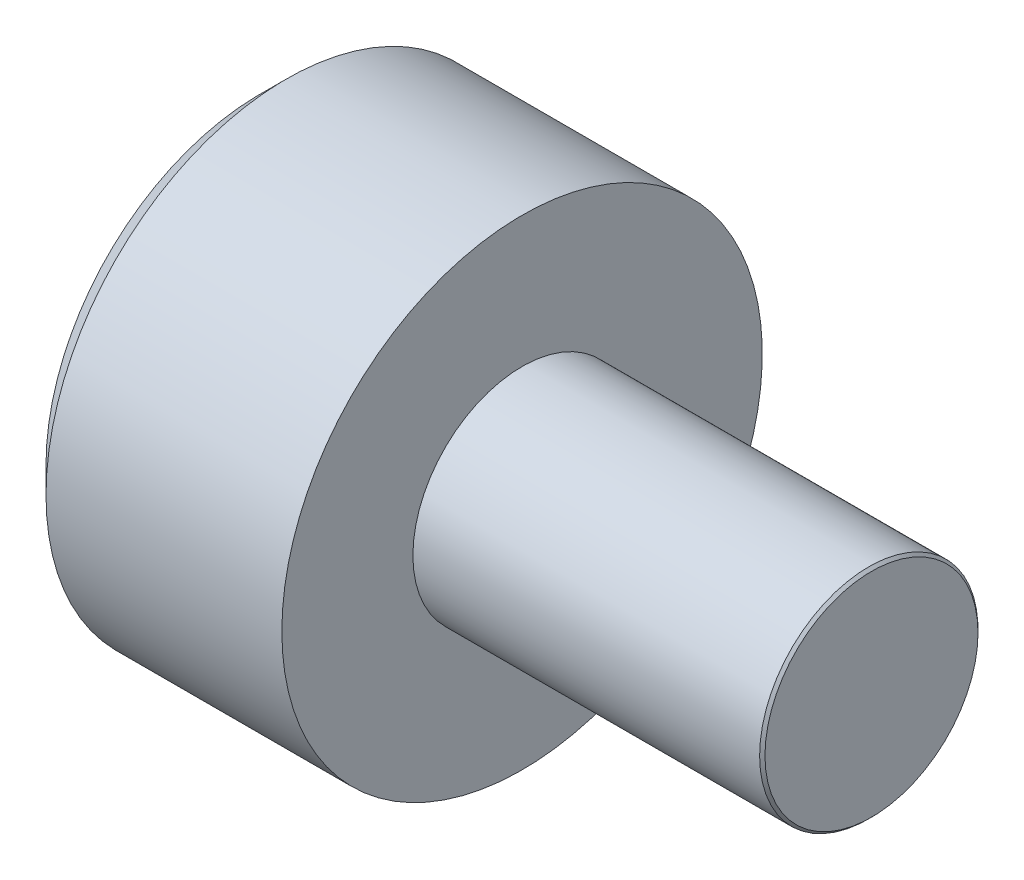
from build123d import *

# Parameters (mm, degrees)
HEX_2_DEPTH = 1.3


with BuildPart() as part:
    # BodySke → Base-Revolve (revolve)
    with BuildSketch(Plane.XY, mode=Mode.PRIVATE) as base_revolve_sk:
        Polygon((0, 0), (0, 2.45), (0.3, 2.75), (3, 2.75), (3, 1.25), (6.9695, 1.25), (7, 1.2195), (7, 0), align=None)
    revolve(base_revolve_sk.sketch.rotate(Axis((-5.305295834, 0, 0), (1, 0, 0)), 90), axis=Axis((-5.305295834, 0, 0), (1, 0, 0)))

    # Sketch2 → Hex-PreBroach (revolve, cut)
    with BuildSketch(Plane.XY, mode=Mode.PRIVATE) as hex_prebroach_sk:
        Polygon((0, 1.28), (1.3, 1.28), (2.039008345, 0), (0, 0), align=None)
    revolve(hex_prebroach_sk.sketch.rotate(Axis((0, 0, 0), (1, 0, 0)), 90), axis=Axis((0, 0, 0), (1, 0, 0)), mode=Mode.SUBTRACT)

    # Sketch3 → Hex 2 (cut)
    with BuildSketch(Plane(origin=(0, 0, 0), x_dir=(0, 0.500000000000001, 0.866025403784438), z_dir=(-1, 0, 0))):
        Polygon((0.739008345, 1.28), (-0.739008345, 1.28), (-1.478016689, 0), (-0.739008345, -1.28), (0.739008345, -1.28), (1.478016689, 0), align=None)
    extrude(amount=-HEX_2_DEPTH, mode=Mode.SUBTRACT)


solid = part.part
